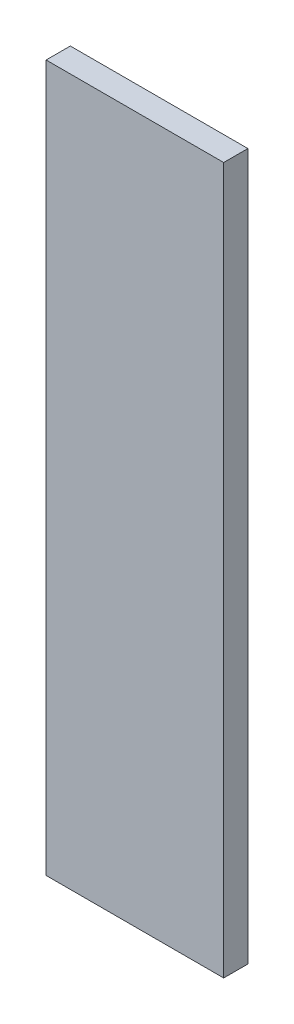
ISO-10303-21;
HEADER;
FILE_DESCRIPTION(('STEP AP214'),'2;1');
FILE_NAME('part.step','',(''),(''),'','','');
FILE_SCHEMA(('AUTOMOTIVE_DESIGN { 1 0 10303 214 1 1 1 1 }'));
ENDSEC;
DATA;
#1=APPLICATION_CONTEXT('core data for automotive mechanical design processes');
#2=APPLICATION_PROTOCOL_DEFINITION('international standard','automotive_design',2000,#1);
#3=PRODUCT_CONTEXT('',#1,'mechanical');
#4=PRODUCT('Part','Part','',(#3));
#5=PRODUCT_RELATED_PRODUCT_CATEGORY('part','',(#4));
#6=PRODUCT_DEFINITION_FORMATION('','',#4);
#7=PRODUCT_DEFINITION_CONTEXT('part definition',#1,'design');
#8=PRODUCT_DEFINITION('design','',#6,#7);
#9=PRODUCT_DEFINITION_SHAPE('','',#8);
#10=(LENGTH_UNIT() NAMED_UNIT(*) SI_UNIT(.MILLI.,.METRE.));
#11=(NAMED_UNIT(*) PLANE_ANGLE_UNIT() SI_UNIT($,.RADIAN.));
#12=(NAMED_UNIT(*) SI_UNIT($,.STERADIAN.) SOLID_ANGLE_UNIT());
#13=UNCERTAINTY_MEASURE_WITH_UNIT(LENGTH_MEASURE(1.E-05),#10,'distance_accuracy_value','');
#14=(GEOMETRIC_REPRESENTATION_CONTEXT(3) GLOBAL_UNCERTAINTY_ASSIGNED_CONTEXT((#13)) GLOBAL_UNIT_ASSIGNED_CONTEXT((#10,
#11,#12)) REPRESENTATION_CONTEXT('',''));
#15=CARTESIAN_POINT('',(0.,0.,0.));
#16=DIRECTION('',(0.,0.,1.));
#17=DIRECTION('',(1.,0.,0.));
#18=AXIS2_PLACEMENT_3D('',#15,#16,#17);
#19=CARTESIAN_POINT('',(0.,0.,6.));
#20=DIRECTION('',(0.,0.,1.));
#21=DIRECTION('',(1.,0.,0.));
#22=AXIS2_PLACEMENT_3D('',#19,#20,#21);
#23=PLANE('',#22);
#24=DIRECTION('',(1.,0.,0.));
#25=VECTOR('',#24,1.);
#26=CARTESIAN_POINT('',(-22.,-87.5,6.));
#27=LINE('',#26,#25);
#28=CARTESIAN_POINT('',(-22.,-87.5,6.));
#29=VERTEX_POINT('',#28);
#30=CARTESIAN_POINT('',(22.,-87.5,6.));
#31=VERTEX_POINT('',#30);
#32=EDGE_CURVE('E80',#29,#31,#27,.T.);
#33=ORIENTED_EDGE('',*,*,#32,.T.);
#34=DIRECTION('',(0.,1.,0.));
#35=VECTOR('',#34,1.);
#36=CARTESIAN_POINT('',(22.,-87.5,6.));
#37=LINE('',#36,#35);
#38=CARTESIAN_POINT('',(22.,87.5,6.));
#39=VERTEX_POINT('',#38);
#40=EDGE_CURVE('E105',#31,#39,#37,.T.);
#41=ORIENTED_EDGE('',*,*,#40,.T.);
#42=DIRECTION('',(-1.,0.,0.));
#43=VECTOR('',#42,1.);
#44=CARTESIAN_POINT('',(22.,87.5,6.));
#45=LINE('',#44,#43);
#46=CARTESIAN_POINT('',(-22.,87.5,6.));
#47=VERTEX_POINT('',#46);
#48=EDGE_CURVE('E73',#39,#47,#45,.T.);
#49=ORIENTED_EDGE('',*,*,#48,.T.);
#50=DIRECTION('',(0.,-1.,0.));
#51=VECTOR('',#50,1.);
#52=CARTESIAN_POINT('',(-22.,87.5,6.));
#53=LINE('',#52,#51);
#54=EDGE_CURVE('E10',#47,#29,#53,.T.);
#55=ORIENTED_EDGE('',*,*,#54,.T.);
#56=EDGE_LOOP('',(#33,#41,#49,#55));
#57=FACE_BOUND('',#56,.T.);
#58=ADVANCED_FACE('F16',(#57),#23,.T.);
#59=CARTESIAN_POINT('',(0.,0.,0.));
#60=DIRECTION('',(0.,0.,1.));
#61=DIRECTION('',(1.,0.,0.));
#62=AXIS2_PLACEMENT_3D('',#59,#60,#61);
#63=PLANE('',#62);
#64=DIRECTION('',(0.,-1.,0.));
#65=VECTOR('',#64,1.);
#66=CARTESIAN_POINT('',(-22.,87.5,0.));
#67=LINE('',#66,#65);
#68=CARTESIAN_POINT('',(-22.,87.5,0.));
#69=VERTEX_POINT('',#68);
#70=CARTESIAN_POINT('',(-22.,-87.5,0.));
#71=VERTEX_POINT('',#70);
#72=EDGE_CURVE('E25',#69,#71,#67,.T.);
#73=ORIENTED_EDGE('',*,*,#72,.F.);
#74=DIRECTION('',(-1.,0.,0.));
#75=VECTOR('',#74,1.);
#76=CARTESIAN_POINT('',(22.,87.5,0.));
#77=LINE('',#76,#75);
#78=CARTESIAN_POINT('',(22.,87.5,0.));
#79=VERTEX_POINT('',#78);
#80=EDGE_CURVE('E98',#79,#69,#77,.T.);
#81=ORIENTED_EDGE('',*,*,#80,.F.);
#82=DIRECTION('',(0.,1.,0.));
#83=VECTOR('',#82,1.);
#84=CARTESIAN_POINT('',(22.,-87.5,0.));
#85=LINE('',#84,#83);
#86=CARTESIAN_POINT('',(22.,-87.5,0.));
#87=VERTEX_POINT('',#86);
#88=EDGE_CURVE('E82',#87,#79,#85,.T.);
#89=ORIENTED_EDGE('',*,*,#88,.F.);
#90=DIRECTION('',(1.,0.,0.));
#91=VECTOR('',#90,1.);
#92=CARTESIAN_POINT('',(-22.,-87.5,0.));
#93=LINE('',#92,#91);
#94=EDGE_CURVE('E78',#71,#87,#93,.T.);
#95=ORIENTED_EDGE('',*,*,#94,.F.);
#96=EDGE_LOOP('',(#73,#81,#89,#95));
#97=FACE_BOUND('',#96,.T.);
#98=ADVANCED_FACE('F84',(#97),#63,.F.);
#99=CARTESIAN_POINT('',(-22.,87.5,0.));
#100=DIRECTION('',(1.,0.,0.));
#101=DIRECTION('',(0.,1.,0.));
#102=AXIS2_PLACEMENT_3D('',#99,#100,#101);
#103=PLANE('',#102);
#104=ORIENTED_EDGE('',*,*,#72,.T.);
#105=DIRECTION('',(0.,0.,1.));
#106=VECTOR('',#105,1.);
#107=CARTESIAN_POINT('',(-22.,-87.5,0.));
#108=LINE('',#107,#106);
#109=EDGE_CURVE('E67',#71,#29,#108,.T.);
#110=ORIENTED_EDGE('',*,*,#109,.T.);
#111=ORIENTED_EDGE('',*,*,#54,.F.);
#112=DIRECTION('',(0.,0.,1.));
#113=VECTOR('',#112,1.);
#114=CARTESIAN_POINT('',(-22.,87.5,0.));
#115=LINE('',#114,#113);
#116=EDGE_CURVE('E70',#69,#47,#115,.T.);
#117=ORIENTED_EDGE('',*,*,#116,.F.);
#118=EDGE_LOOP('',(#104,#110,#111,#117));
#119=FACE_BOUND('',#118,.T.);
#120=ADVANCED_FACE('F18',(#119),#103,.F.);
#121=CARTESIAN_POINT('',(22.,87.5,0.));
#122=DIRECTION('',(0.,-1.,0.));
#123=DIRECTION('',(0.,0.,-1.));
#124=AXIS2_PLACEMENT_3D('',#121,#122,#123);
#125=PLANE('',#124);
#126=ORIENTED_EDGE('',*,*,#80,.T.);
#127=ORIENTED_EDGE('',*,*,#116,.T.);
#128=ORIENTED_EDGE('',*,*,#48,.F.);
#129=DIRECTION('',(0.,0.,1.));
#130=VECTOR('',#129,1.);
#131=CARTESIAN_POINT('',(22.,87.5,0.));
#132=LINE('',#131,#130);
#133=EDGE_CURVE('E101',#79,#39,#132,.T.);
#134=ORIENTED_EDGE('',*,*,#133,.F.);
#135=EDGE_LOOP('',(#126,#127,#128,#134));
#136=FACE_BOUND('',#135,.T.);
#137=ADVANCED_FACE('F115',(#136),#125,.F.);
#138=CARTESIAN_POINT('',(22.,-87.5,0.));
#139=DIRECTION('',(-1.,0.,0.));
#140=DIRECTION('',(0.,0.,1.));
#141=AXIS2_PLACEMENT_3D('',#138,#139,#140);
#142=PLANE('',#141);
#143=ORIENTED_EDGE('',*,*,#88,.T.);
#144=ORIENTED_EDGE('',*,*,#133,.T.);
#145=ORIENTED_EDGE('',*,*,#40,.F.);
#146=DIRECTION('',(0.,0.,1.));
#147=VECTOR('',#146,1.);
#148=CARTESIAN_POINT('',(22.,-87.5,0.));
#149=LINE('',#148,#147);
#150=EDGE_CURVE('E88',#87,#31,#149,.T.);
#151=ORIENTED_EDGE('',*,*,#150,.F.);
#152=EDGE_LOOP('',(#143,#144,#145,#151));
#153=FACE_BOUND('',#152,.T.);
#154=ADVANCED_FACE('F117',(#153),#142,.F.);
#155=CARTESIAN_POINT('',(-22.,-87.5,0.));
#156=DIRECTION('',(0.,1.,0.));
#157=DIRECTION('',(1.,0.,0.));
#158=AXIS2_PLACEMENT_3D('',#155,#156,#157);
#159=PLANE('',#158);
#160=ORIENTED_EDGE('',*,*,#94,.T.);
#161=ORIENTED_EDGE('',*,*,#150,.T.);
#162=ORIENTED_EDGE('',*,*,#32,.F.);
#163=ORIENTED_EDGE('',*,*,#109,.F.);
#164=EDGE_LOOP('',(#160,#161,#162,#163));
#165=FACE_BOUND('',#164,.T.);
#166=ADVANCED_FACE('F76',(#165),#159,.F.);
#167=CLOSED_SHELL('',(#58,#98,#120,#137,#154,#166));
#168=MANIFOLD_SOLID_BREP('B1',#167);
#169=ADVANCED_BREP_SHAPE_REPRESENTATION('',(#18,#168),#14);
#170=SHAPE_DEFINITION_REPRESENTATION(#9,#169);
ENDSEC;
END-ISO-10303-21;
